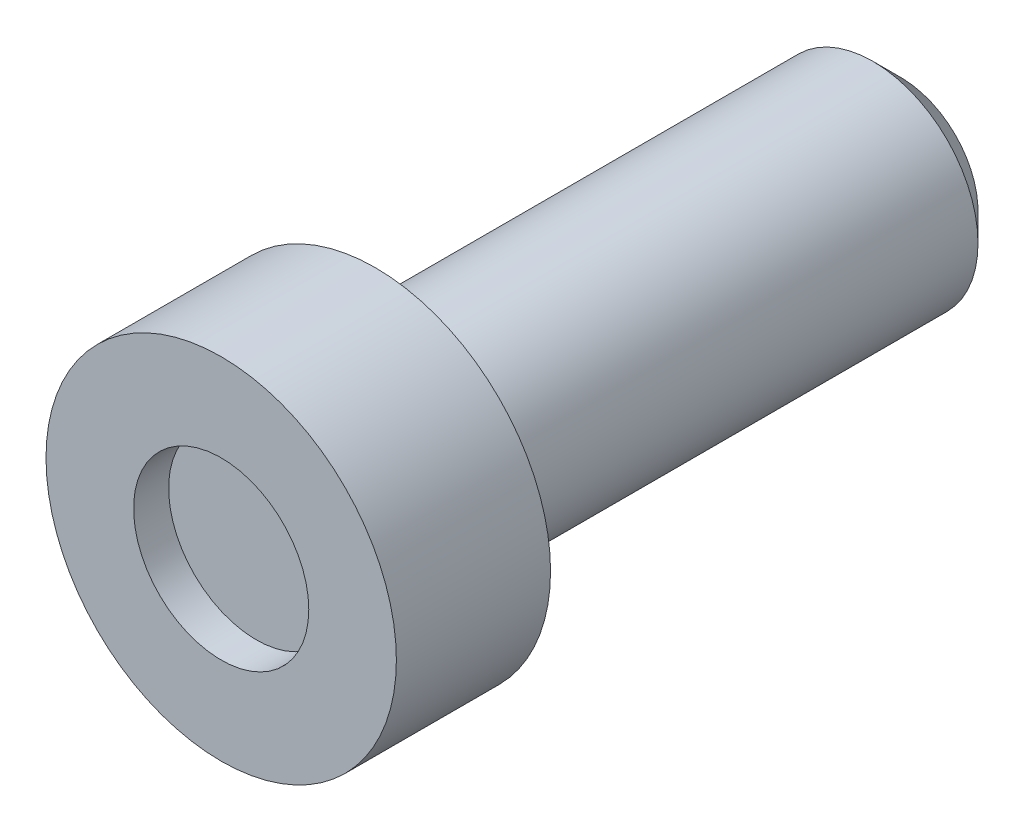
ISO-10303-21;
HEADER;
FILE_DESCRIPTION(('STEP AP214'),'2;1');
FILE_NAME('part.step','',(''),(''),'','','');
FILE_SCHEMA(('AUTOMOTIVE_DESIGN { 1 0 10303 214 1 1 1 1 }'));
ENDSEC;
DATA;
#1=APPLICATION_CONTEXT('core data for automotive mechanical design processes');
#2=APPLICATION_PROTOCOL_DEFINITION('international standard','automotive_design',2000,#1);
#3=PRODUCT_CONTEXT('',#1,'mechanical');
#4=PRODUCT('Part','Part','',(#3));
#5=PRODUCT_RELATED_PRODUCT_CATEGORY('part','',(#4));
#6=PRODUCT_DEFINITION_FORMATION('','',#4);
#7=PRODUCT_DEFINITION_CONTEXT('part definition',#1,'design');
#8=PRODUCT_DEFINITION('design','',#6,#7);
#9=PRODUCT_DEFINITION_SHAPE('','',#8);
#10=(LENGTH_UNIT() NAMED_UNIT(*) SI_UNIT(.MILLI.,.METRE.));
#11=(NAMED_UNIT(*) PLANE_ANGLE_UNIT() SI_UNIT($,.RADIAN.));
#12=(NAMED_UNIT(*) SI_UNIT($,.STERADIAN.) SOLID_ANGLE_UNIT());
#13=UNCERTAINTY_MEASURE_WITH_UNIT(LENGTH_MEASURE(1.E-05),#10,'distance_accuracy_value','');
#14=(GEOMETRIC_REPRESENTATION_CONTEXT(3) GLOBAL_UNCERTAINTY_ASSIGNED_CONTEXT((#13)) GLOBAL_UNIT_ASSIGNED_CONTEXT((#10,
#11,#12)) REPRESENTATION_CONTEXT('',''));
#15=CARTESIAN_POINT('',(0.,0.,0.));
#16=DIRECTION('',(0.,0.,1.));
#17=DIRECTION('',(1.,0.,0.));
#18=AXIS2_PLACEMENT_3D('',#15,#16,#17);
#19=CARTESIAN_POINT('',(0.,0.,0.));
#20=DIRECTION('',(0.,0.,1.));
#21=DIRECTION('',(1.,0.,0.));
#22=AXIS2_PLACEMENT_3D('',#19,#20,#21);
#23=PLANE('',#22);
#24=CARTESIAN_POINT('',(0.,0.,0.));
#25=DIRECTION('',(0.,0.,1.));
#26=DIRECTION('',(1.,0.,0.));
#27=AXIS2_PLACEMENT_3D('',#24,#25,#26);
#28=CIRCLE('',#27,25.);
#29=CARTESIAN_POINT('',(25.,0.,0.));
#30=VERTEX_POINT('',#29);
#31=EDGE_CURVE('E49',#30,#30,#28,.T.);
#32=ORIENTED_EDGE('',*,*,#31,.F.);
#33=EDGE_LOOP('',(#32));
#34=FACE_BOUND('',#33,.T.);
#35=CARTESIAN_POINT('',(0.,0.,0.));
#36=DIRECTION('',(0.,0.,1.));
#37=DIRECTION('',(1.,0.,0.));
#38=AXIS2_PLACEMENT_3D('',#35,#36,#37);
#39=CIRCLE('',#38,15.);
#40=CARTESIAN_POINT('',(15.,0.,0.));
#41=VERTEX_POINT('',#40);
#42=EDGE_CURVE('E40',#41,#41,#39,.F.);
#43=ORIENTED_EDGE('',*,*,#42,.F.);
#44=EDGE_LOOP('',(#43));
#45=FACE_BOUND('',#44,.T.);
#46=ADVANCED_FACE('F29',(#34,#45),#23,.F.);
#47=CARTESIAN_POINT('',(0.,0.,22.));
#48=DIRECTION('',(0.,0.,-1.));
#49=DIRECTION('',(-1.,0.,0.));
#50=AXIS2_PLACEMENT_3D('',#47,#48,#49);
#51=CYLINDRICAL_SURFACE('',#50,25.);
#52=CARTESIAN_POINT('',(0.,0.,22.));
#53=DIRECTION('',(0.,0.,1.));
#54=DIRECTION('',(1.,0.,0.));
#55=AXIS2_PLACEMENT_3D('',#52,#53,#54);
#56=CIRCLE('',#55,25.);
#57=CARTESIAN_POINT('',(25.,0.,22.));
#58=VERTEX_POINT('',#57);
#59=EDGE_CURVE('E44',#58,#58,#56,.T.);
#60=ORIENTED_EDGE('',*,*,#59,.F.);
#61=EDGE_LOOP('',(#60));
#62=FACE_BOUND('',#61,.T.);
#63=ORIENTED_EDGE('',*,*,#31,.T.);
#64=EDGE_LOOP('',(#63));
#65=FACE_BOUND('',#64,.T.);
#66=ADVANCED_FACE('F31',(#62,#65),#51,.T.);
#67=CARTESIAN_POINT('',(0.,0.,22.));
#68=DIRECTION('',(0.,0.,1.));
#69=DIRECTION('',(1.,0.,0.));
#70=AXIS2_PLACEMENT_3D('',#67,#68,#69);
#71=PLANE('',#70);
#72=CARTESIAN_POINT('',(0.,0.,22.));
#73=DIRECTION('',(0.,0.,1.));
#74=DIRECTION('',(1.,0.,0.));
#75=AXIS2_PLACEMENT_3D('',#72,#73,#74);
#76=CIRCLE('',#75,12.5);
#77=CARTESIAN_POINT('',(12.5,0.,22.));
#78=VERTEX_POINT('',#77);
#79=EDGE_CURVE('E55',#78,#78,#76,.T.);
#80=ORIENTED_EDGE('',*,*,#79,.F.);
#81=EDGE_LOOP('',(#80));
#82=FACE_BOUND('',#81,.T.);
#83=ORIENTED_EDGE('',*,*,#59,.T.);
#84=EDGE_LOOP('',(#83));
#85=FACE_BOUND('',#84,.T.);
#86=ADVANCED_FACE('F61',(#82,#85),#71,.T.);
#87=CARTESIAN_POINT('',(0.,0.,17.));
#88=DIRECTION('',(0.,0.,1.));
#89=DIRECTION('',(1.,0.,0.));
#90=AXIS2_PLACEMENT_3D('',#87,#88,#89);
#91=CYLINDRICAL_SURFACE('',#90,12.5);
#92=CARTESIAN_POINT('',(0.,0.,17.));
#93=DIRECTION('',(0.,0.,1.));
#94=DIRECTION('',(1.,0.,0.));
#95=AXIS2_PLACEMENT_3D('',#92,#93,#94);
#96=CIRCLE('',#95,12.5);
#97=CARTESIAN_POINT('',(12.5,0.,17.));
#98=VERTEX_POINT('',#97);
#99=EDGE_CURVE('E52',#98,#98,#96,.T.);
#100=ORIENTED_EDGE('',*,*,#99,.F.);
#101=EDGE_LOOP('',(#100));
#102=FACE_BOUND('',#101,.T.);
#103=ORIENTED_EDGE('',*,*,#79,.T.);
#104=EDGE_LOOP('',(#103));
#105=FACE_BOUND('',#104,.T.);
#106=ADVANCED_FACE('F59',(#102,#105),#91,.F.);
#107=CARTESIAN_POINT('',(0.,0.,17.));
#108=DIRECTION('',(0.,0.,1.));
#109=DIRECTION('',(1.,0.,0.));
#110=AXIS2_PLACEMENT_3D('',#107,#108,#109);
#111=PLANE('',#110);
#112=ORIENTED_EDGE('',*,*,#99,.T.);
#113=EDGE_LOOP('',(#112));
#114=FACE_BOUND('',#113,.T.);
#115=ADVANCED_FACE('F78',(#114),#111,.T.);
#116=CARTESIAN_POINT('',(0.,0.,-75.));
#117=DIRECTION('',(0.,0.,1.));
#118=DIRECTION('',(1.,0.,0.));
#119=AXIS2_PLACEMENT_3D('',#116,#117,#118);
#120=CYLINDRICAL_SURFACE('',#119,15.);
#121=CARTESIAN_POINT('',(0.,0.,-71.));
#122=DIRECTION('',(0.,0.,-1.));
#123=DIRECTION('',(-1.,0.,0.));
#124=AXIS2_PLACEMENT_3D('',#121,#122,#123);
#125=CIRCLE('',#124,15.);
#126=CARTESIAN_POINT('',(-15.,0.,-71.));
#127=VERTEX_POINT('',#126);
#128=EDGE_CURVE('E10',#127,#127,#125,.F.);
#129=ORIENTED_EDGE('',*,*,#128,.T.);
#130=EDGE_LOOP('',(#129));
#131=FACE_BOUND('',#130,.T.);
#132=ORIENTED_EDGE('',*,*,#42,.T.);
#133=EDGE_LOOP('',(#132));
#134=FACE_BOUND('',#133,.T.);
#135=ADVANCED_FACE('F75',(#131,#134),#120,.T.);
#136=CARTESIAN_POINT('',(0.,0.,-75.));
#137=DIRECTION('',(0.,0.,-1.));
#138=DIRECTION('',(-1.,0.,0.));
#139=AXIS2_PLACEMENT_3D('',#136,#137,#138);
#140=PLANE('',#139);
#141=CARTESIAN_POINT('',(0.,0.,-75.));
#142=DIRECTION('',(0.,0.,-1.));
#143=DIRECTION('',(-1.,0.,0.));
#144=AXIS2_PLACEMENT_3D('',#141,#142,#143);
#145=CIRCLE('',#144,11.);
#146=CARTESIAN_POINT('',(-11.,0.,-75.));
#147=VERTEX_POINT('',#146);
#148=EDGE_CURVE('E36',#147,#147,#145,.T.);
#149=ORIENTED_EDGE('',*,*,#148,.T.);
#150=EDGE_LOOP('',(#149));
#151=FACE_BOUND('',#150,.T.);
#152=ADVANCED_FACE('F77',(#151),#140,.T.);
#153=CARTESIAN_POINT('',(0.,0.,-75.));
#154=DIRECTION('',(0.,0.,1.));
#155=DIRECTION('',(1.,0.,0.));
#156=AXIS2_PLACEMENT_3D('',#153,#154,#155);
#157=CONICAL_SURFACE('',#156,11.,0.785398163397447);
#158=ORIENTED_EDGE('',*,*,#128,.F.);
#159=EDGE_LOOP('',(#158));
#160=FACE_BOUND('',#159,.T.);
#161=ORIENTED_EDGE('',*,*,#148,.F.);
#162=EDGE_LOOP('',(#161));
#163=FACE_BOUND('',#162,.T.);
#164=ADVANCED_FACE('F84',(#160,#163),#157,.T.);
#165=CLOSED_SHELL('',(#46,#66,#86,#106,#115,#135,#152,#164));
#166=MANIFOLD_SOLID_BREP('B2',#165);
#167=ADVANCED_BREP_SHAPE_REPRESENTATION('',(#18,#166),#14);
#168=SHAPE_DEFINITION_REPRESENTATION(#9,#167);
ENDSEC;
END-ISO-10303-21;
